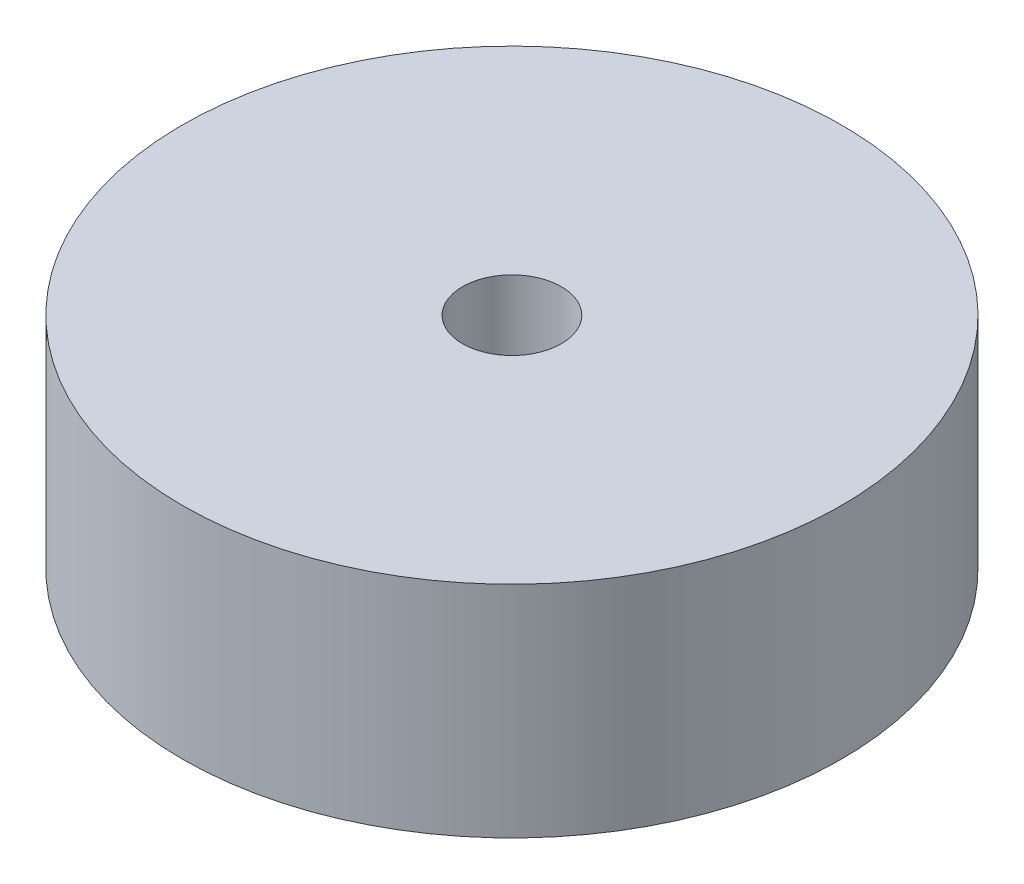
ISO-10303-21;
HEADER;
FILE_DESCRIPTION(('STEP AP214'),'2;1');
FILE_NAME('part.step','',(''),(''),'','','');
FILE_SCHEMA(('AUTOMOTIVE_DESIGN { 1 0 10303 214 1 1 1 1 }'));
ENDSEC;
DATA;
#1=APPLICATION_CONTEXT('core data for automotive mechanical design processes');
#2=APPLICATION_PROTOCOL_DEFINITION('international standard','automotive_design',2000,#1);
#3=PRODUCT_CONTEXT('',#1,'mechanical');
#4=PRODUCT('Part','Part','',(#3));
#5=PRODUCT_RELATED_PRODUCT_CATEGORY('part','',(#4));
#6=PRODUCT_DEFINITION_FORMATION('','',#4);
#7=PRODUCT_DEFINITION_CONTEXT('part definition',#1,'design');
#8=PRODUCT_DEFINITION('design','',#6,#7);
#9=PRODUCT_DEFINITION_SHAPE('','',#8);
#10=(LENGTH_UNIT() NAMED_UNIT(*) SI_UNIT(.MILLI.,.METRE.));
#11=(NAMED_UNIT(*) PLANE_ANGLE_UNIT() SI_UNIT($,.RADIAN.));
#12=(NAMED_UNIT(*) SI_UNIT($,.STERADIAN.) SOLID_ANGLE_UNIT());
#13=UNCERTAINTY_MEASURE_WITH_UNIT(LENGTH_MEASURE(1.E-05),#10,'distance_accuracy_value','');
#14=(GEOMETRIC_REPRESENTATION_CONTEXT(3) GLOBAL_UNCERTAINTY_ASSIGNED_CONTEXT((#13)) GLOBAL_UNIT_ASSIGNED_CONTEXT((#10,
#11,#12)) REPRESENTATION_CONTEXT('',''));
#15=CARTESIAN_POINT('',(0.,0.,0.));
#16=DIRECTION('',(0.,0.,1.));
#17=DIRECTION('',(1.,0.,0.));
#18=AXIS2_PLACEMENT_3D('',#15,#16,#17);
#19=CARTESIAN_POINT('',(0.,10.,0.));
#20=DIRECTION('',(0.,1.,0.));
#21=DIRECTION('',(0.,0.,1.));
#22=AXIS2_PLACEMENT_3D('',#19,#20,#21);
#23=PLANE('',#22);
#24=CARTESIAN_POINT('',(0.,10.,0.));
#25=DIRECTION('',(0.,1.,0.));
#26=DIRECTION('',(0.,0.,1.));
#27=AXIS2_PLACEMENT_3D('',#24,#25,#26);
#28=CIRCLE('',#27,15.);
#29=CARTESIAN_POINT('',(0.,10.,15.));
#30=VERTEX_POINT('',#29);
#31=EDGE_CURVE('E10',#30,#30,#28,.T.);
#32=ORIENTED_EDGE('',*,*,#31,.T.);
#33=EDGE_LOOP('',(#32));
#34=FACE_BOUND('',#33,.T.);
#35=CARTESIAN_POINT('',(0.,10.,0.));
#36=DIRECTION('',(0.,1.,0.));
#37=DIRECTION('',(0.,0.,1.));
#38=AXIS2_PLACEMENT_3D('',#35,#36,#37);
#39=CIRCLE('',#38,2.25);
#40=CARTESIAN_POINT('',(0.,10.,2.25));
#41=VERTEX_POINT('',#40);
#42=EDGE_CURVE('E40',#41,#41,#39,.T.);
#43=ORIENTED_EDGE('',*,*,#42,.F.);
#44=EDGE_LOOP('',(#43));
#45=FACE_BOUND('',#44,.T.);
#46=ADVANCED_FACE('F29',(#34,#45),#23,.T.);
#47=CARTESIAN_POINT('',(0.,0.,0.));
#48=DIRECTION('',(0.,1.,0.));
#49=DIRECTION('',(0.,0.,1.));
#50=AXIS2_PLACEMENT_3D('',#47,#48,#49);
#51=PLANE('',#50);
#52=CARTESIAN_POINT('',(0.,0.,0.));
#53=DIRECTION('',(0.,1.,0.));
#54=DIRECTION('',(0.,0.,1.));
#55=AXIS2_PLACEMENT_3D('',#52,#53,#54);
#56=CIRCLE('',#55,15.);
#57=CARTESIAN_POINT('',(0.,0.,15.));
#58=VERTEX_POINT('',#57);
#59=EDGE_CURVE('E33',#58,#58,#56,.T.);
#60=ORIENTED_EDGE('',*,*,#59,.F.);
#61=EDGE_LOOP('',(#60));
#62=FACE_BOUND('',#61,.T.);
#63=CARTESIAN_POINT('',(0.,0.,0.));
#64=DIRECTION('',(0.,1.,0.));
#65=DIRECTION('',(0.,0.,1.));
#66=AXIS2_PLACEMENT_3D('',#63,#64,#65);
#67=CIRCLE('',#66,2.25);
#68=CARTESIAN_POINT('',(0.,0.,2.25));
#69=VERTEX_POINT('',#68);
#70=EDGE_CURVE('E42',#69,#69,#67,.T.);
#71=ORIENTED_EDGE('',*,*,#70,.T.);
#72=EDGE_LOOP('',(#71));
#73=FACE_BOUND('',#72,.T.);
#74=ADVANCED_FACE('F52',(#62,#73),#51,.F.);
#75=CARTESIAN_POINT('',(0.,10.,0.));
#76=DIRECTION('',(0.,-1.,0.));
#77=DIRECTION('',(0.,0.,-1.));
#78=AXIS2_PLACEMENT_3D('',#75,#76,#77);
#79=CYLINDRICAL_SURFACE('',#78,15.);
#80=ORIENTED_EDGE('',*,*,#31,.F.);
#81=EDGE_LOOP('',(#80));
#82=FACE_BOUND('',#81,.T.);
#83=ORIENTED_EDGE('',*,*,#59,.T.);
#84=EDGE_LOOP('',(#83));
#85=FACE_BOUND('',#84,.T.);
#86=ADVANCED_FACE('F31',(#82,#85),#79,.T.);
#87=CARTESIAN_POINT('',(0.,10.,0.));
#88=DIRECTION('',(0.,-1.,0.));
#89=DIRECTION('',(0.,0.,-1.));
#90=AXIS2_PLACEMENT_3D('',#87,#88,#89);
#91=CYLINDRICAL_SURFACE('',#90,2.25);
#92=ORIENTED_EDGE('',*,*,#42,.T.);
#93=EDGE_LOOP('',(#92));
#94=FACE_BOUND('',#93,.T.);
#95=ORIENTED_EDGE('',*,*,#70,.F.);
#96=EDGE_LOOP('',(#95));
#97=FACE_BOUND('',#96,.T.);
#98=ADVANCED_FACE('F48',(#94,#97),#91,.F.);
#99=CLOSED_SHELL('',(#46,#74,#86,#98));
#100=MANIFOLD_SOLID_BREP('B2',#99);
#101=ADVANCED_BREP_SHAPE_REPRESENTATION('',(#18,#100),#14);
#102=SHAPE_DEFINITION_REPRESENTATION(#9,#101);
ENDSEC;
END-ISO-10303-21;
